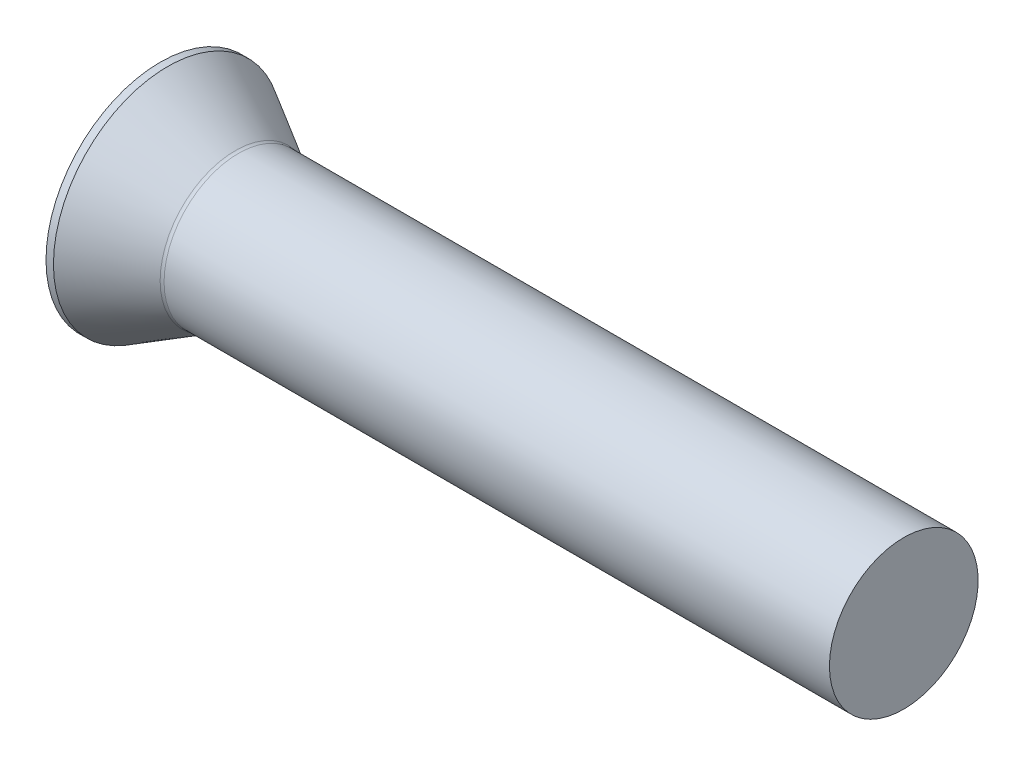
ISO-10303-21;
HEADER;
FILE_DESCRIPTION(('STEP AP214'),'2;1');
FILE_NAME('part.step','',(''),(''),'','','');
FILE_SCHEMA(('AUTOMOTIVE_DESIGN { 1 0 10303 214 1 1 1 1 }'));
ENDSEC;
DATA;
#1=APPLICATION_CONTEXT('core data for automotive mechanical design processes');
#2=APPLICATION_PROTOCOL_DEFINITION('international standard','automotive_design',2000,#1);
#3=PRODUCT_CONTEXT('',#1,'mechanical');
#4=PRODUCT('Part','Part','',(#3));
#5=PRODUCT_RELATED_PRODUCT_CATEGORY('part','',(#4));
#6=PRODUCT_DEFINITION_FORMATION('','',#4);
#7=PRODUCT_DEFINITION_CONTEXT('part definition',#1,'design');
#8=PRODUCT_DEFINITION('design','',#6,#7);
#9=PRODUCT_DEFINITION_SHAPE('','',#8);
#10=(LENGTH_UNIT() NAMED_UNIT(*) SI_UNIT(.MILLI.,.METRE.));
#11=(NAMED_UNIT(*) PLANE_ANGLE_UNIT() SI_UNIT($,.RADIAN.));
#12=(NAMED_UNIT(*) SI_UNIT($,.STERADIAN.) SOLID_ANGLE_UNIT());
#13=UNCERTAINTY_MEASURE_WITH_UNIT(LENGTH_MEASURE(1.E-05),#10,'distance_accuracy_value','');
#14=(GEOMETRIC_REPRESENTATION_CONTEXT(3) GLOBAL_UNCERTAINTY_ASSIGNED_CONTEXT((#13)) GLOBAL_UNIT_ASSIGNED_CONTEXT((#10,
#11,#12)) REPRESENTATION_CONTEXT('',''));
#15=CARTESIAN_POINT('',(0.,0.,0.));
#16=DIRECTION('',(0.,0.,1.));
#17=DIRECTION('',(1.,0.,0.));
#18=AXIS2_PLACEMENT_3D('',#15,#16,#17);
#19=CARTESIAN_POINT('',(62.6250140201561,0.,0.));
#20=DIRECTION('',(-1.,0.,0.));
#21=DIRECTION('',(0.,0.,1.));
#22=AXIS2_PLACEMENT_3D('',#19,#20,#21);
#23=PLANE('',#22);
#24=CARTESIAN_POINT('',(62.6250140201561,0.,0.));
#25=DIRECTION('',(-1.,0.,0.));
#26=DIRECTION('',(0.,0.,1.));
#27=AXIS2_PLACEMENT_3D('',#24,#25,#26);
#28=CIRCLE('',#27,6.00000000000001);
#29=CARTESIAN_POINT('',(62.6250140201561,0.,6.00000000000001));
#30=VERTEX_POINT('',#29);
#31=EDGE_CURVE('E10',#30,#30,#28,.T.);
#32=ORIENTED_EDGE('',*,*,#31,.F.);
#33=EDGE_LOOP('',(#32));
#34=FACE_BOUND('',#33,.T.);
#35=ADVANCED_FACE('F31',(#34),#23,.F.);
#36=CARTESIAN_POINT('',(-34.7298882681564,0.,0.));
#37=DIRECTION('',(-1.,0.,0.));
#38=DIRECTION('',(0.,0.,1.));
#39=AXIS2_PLACEMENT_3D('',#36,#37,#38);
#40=CYLINDRICAL_SURFACE('',#39,6.);
#41=CARTESIAN_POINT('',(8.93397459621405,0.,0.));
#42=DIRECTION('',(-1.,0.,0.));
#43=DIRECTION('',(0.,0.,1.));
#44=AXIS2_PLACEMENT_3D('',#41,#42,#43);
#45=CIRCLE('',#44,5.99999999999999);
#46=CARTESIAN_POINT('',(8.93397459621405,0.,5.99999999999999));
#47=VERTEX_POINT('',#46);
#48=EDGE_CURVE('E37',#47,#47,#45,.T.);
#49=ORIENTED_EDGE('',*,*,#48,.F.);
#50=EDGE_LOOP('',(#49));
#51=FACE_BOUND('',#50,.T.);
#52=ORIENTED_EDGE('',*,*,#31,.T.);
#53=EDGE_LOOP('',(#52));
#54=FACE_BOUND('',#53,.T.);
#55=ADVANCED_FACE('F70',(#51,#54),#40,.T.);
#56=CARTESIAN_POINT('',(8.93397459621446,0.,0.));
#57=DIRECTION('',(-1.,0.,0.));
#58=DIRECTION('',(0.,0.,1.));
#59=AXIS2_PLACEMENT_3D('',#56,#57,#58);
#60=TOROIDAL_SURFACE('',#59,6.49999999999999,0.500000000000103);
#61=CARTESIAN_POINT('',(8.6839745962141,0.,0.));
#62=DIRECTION('',(-1.,0.,0.));
#63=DIRECTION('',(0.,0.,1.));
#64=AXIS2_PLACEMENT_3D('',#61,#62,#63);
#65=CIRCLE('',#64,6.06698729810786);
#66=CARTESIAN_POINT('',(8.6839745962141,0.,6.06698729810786));
#67=VERTEX_POINT('',#66);
#68=EDGE_CURVE('E41',#67,#67,#65,.T.);
#69=ORIENTED_EDGE('',*,*,#68,.F.);
#70=EDGE_LOOP('',(#69));
#71=FACE_BOUND('',#70,.T.);
#72=ORIENTED_EDGE('',*,*,#48,.T.);
#73=EDGE_LOOP('',(#72));
#74=FACE_BOUND('',#73,.T.);
#75=ADVANCED_FACE('F65',(#71,#74),#60,.F.);
#76=CARTESIAN_POINT('',(8.6839745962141,0.,0.));
#77=DIRECTION('',(-1.,0.,0.));
#78=DIRECTION('',(0.,0.,1.));
#79=AXIS2_PLACEMENT_3D('',#76,#77,#78);
#80=CONICAL_SURFACE('',#79,6.06698729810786,0.523598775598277);
#81=CARTESIAN_POINT('',(3.22501402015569,0.,0.));
#82=DIRECTION('',(-1.,0.,0.));
#83=DIRECTION('',(0.,0.,1.));
#84=AXIS2_PLACEMENT_3D('',#81,#82,#83);
#85=CIRCLE('',#84,9.21871965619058);
#86=CARTESIAN_POINT('',(3.22501402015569,0.,9.21871965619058));
#87=VERTEX_POINT('',#86);
#88=EDGE_CURVE('E45',#87,#87,#85,.T.);
#89=ORIENTED_EDGE('',*,*,#88,.F.);
#90=EDGE_LOOP('',(#89));
#91=FACE_BOUND('',#90,.T.);
#92=ORIENTED_EDGE('',*,*,#68,.T.);
#93=EDGE_LOOP('',(#92));
#94=FACE_BOUND('',#93,.T.);
#95=ADVANCED_FACE('F59',(#91,#94),#80,.T.);
#96=CARTESIAN_POINT('',(-34.7298882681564,0.,0.));
#97=DIRECTION('',(-1.,0.,0.));
#98=DIRECTION('',(0.,0.,1.));
#99=AXIS2_PLACEMENT_3D('',#96,#97,#98);
#100=CYLINDRICAL_SURFACE('',#99,9.21871965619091);
#101=CARTESIAN_POINT('',(2.62501402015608,0.,0.));
#102=DIRECTION('',(-1.,0.,0.));
#103=DIRECTION('',(0.,0.,1.));
#104=AXIS2_PLACEMENT_3D('',#101,#102,#103);
#105=CIRCLE('',#104,9.21871965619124);
#106=CARTESIAN_POINT('',(2.62501402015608,0.,9.21871965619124));
#107=VERTEX_POINT('',#106);
#108=EDGE_CURVE('E50',#107,#107,#105,.T.);
#109=ORIENTED_EDGE('',*,*,#108,.F.);
#110=EDGE_LOOP('',(#109));
#111=FACE_BOUND('',#110,.T.);
#112=ORIENTED_EDGE('',*,*,#88,.T.);
#113=EDGE_LOOP('',(#112));
#114=FACE_BOUND('',#113,.T.);
#115=ADVANCED_FACE('F56',(#111,#114),#100,.T.);
#116=CARTESIAN_POINT('',(17.5,0.,0.));
#117=DIRECTION('',(-1.,0.,0.));
#118=DIRECTION('',(0.,1.,0.));
#119=AXIS2_PLACEMENT_3D('',#116,#117,#118);
#120=SPHERICAL_SURFACE('',#119,17.5);
#121=ORIENTED_EDGE('',*,*,#108,.T.);
#122=EDGE_LOOP('',(#121));
#123=FACE_BOUND('',#122,.T.);
#124=ADVANCED_FACE('F54',(#123),#120,.T.);
#125=CLOSED_SHELL('',(#35,#55,#75,#95,#115,#124));
#126=MANIFOLD_SOLID_BREP('B2',#125);
#127=ADVANCED_BREP_SHAPE_REPRESENTATION('',(#18,#126),#14);
#128=SHAPE_DEFINITION_REPRESENTATION(#9,#127);
ENDSEC;
END-ISO-10303-21;
